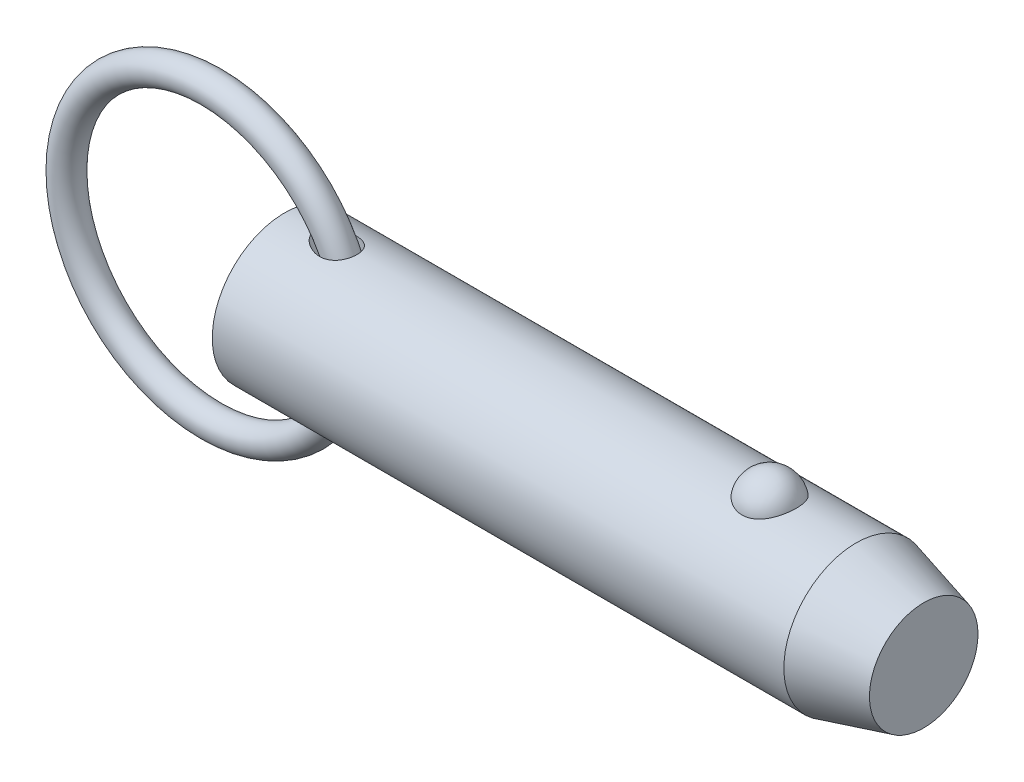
ISO-10303-21;
HEADER;
FILE_DESCRIPTION(('STEP AP214'),'2;1');
FILE_NAME('part.step','',(''),(''),'','','');
FILE_SCHEMA(('AUTOMOTIVE_DESIGN { 1 0 10303 214 1 1 1 1 }'));
ENDSEC;
DATA;
#1=APPLICATION_CONTEXT('core data for automotive mechanical design processes');
#2=APPLICATION_PROTOCOL_DEFINITION('international standard','automotive_design',2000,#1);
#3=PRODUCT_CONTEXT('',#1,'mechanical');
#4=PRODUCT('Part','Part','',(#3));
#5=PRODUCT_RELATED_PRODUCT_CATEGORY('part','',(#4));
#6=PRODUCT_DEFINITION_FORMATION('','',#4);
#7=PRODUCT_DEFINITION_CONTEXT('part definition',#1,'design');
#8=PRODUCT_DEFINITION('design','',#6,#7);
#9=PRODUCT_DEFINITION_SHAPE('','',#8);
#10=(LENGTH_UNIT() NAMED_UNIT(*) SI_UNIT(.MILLI.,.METRE.));
#11=(NAMED_UNIT(*) PLANE_ANGLE_UNIT() SI_UNIT($,.RADIAN.));
#12=(NAMED_UNIT(*) SI_UNIT($,.STERADIAN.) SOLID_ANGLE_UNIT());
#13=UNCERTAINTY_MEASURE_WITH_UNIT(LENGTH_MEASURE(1.E-05),#10,'distance_accuracy_value','');
#14=(GEOMETRIC_REPRESENTATION_CONTEXT(3) GLOBAL_UNCERTAINTY_ASSIGNED_CONTEXT((#13)) GLOBAL_UNIT_ASSIGNED_CONTEXT((#10,
#11,#12)) REPRESENTATION_CONTEXT('',''));
#15=CARTESIAN_POINT('',(0.,0.,0.));
#16=DIRECTION('',(0.,0.,1.));
#17=DIRECTION('',(1.,0.,0.));
#18=AXIS2_PLACEMENT_3D('',#15,#16,#17);
#19=CARTESIAN_POINT('',(-9.66825126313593,0.,0.));
#20=DIRECTION('',(0.,0.,1.));
#21=DIRECTION('',(1.,0.,0.));
#22=AXIS2_PLACEMENT_3D('',#19,#20,#21);
#23=TOROIDAL_SURFACE('',#22,19.05,1.905);
#24=CARTESIAN_POINT('',(11.2867487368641,0.,0.));
#25=VERTEX_POINT('',#24);
#26=VERTEX_LOOP('',#25);
#27=FACE_BOUND('',#26,.T.);
#28=ADVANCED_FACE('P0_F12',(#27),#23,.T.);
#29=CLOSED_SHELL('',(#28));
#30=MANIFOLD_SOLID_BREP('P0_B1',#29);
#31=CARTESIAN_POINT('',(0.,0.,0.));
#32=DIRECTION('',(1.,0.,0.));
#33=DIRECTION('',(0.,0.,-1.));
#34=AXIS2_PLACEMENT_3D('',#31,#32,#33);
#35=CYLINDRICAL_SURFACE('',#34,9.525);
#36=CARTESIAN_POINT('',(4.56693409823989,9.4314194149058,-1.33189820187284));
#37=CARTESIAN_POINT('',(4.70260475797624,9.41020313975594,-1.48215931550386));
#38=CARTESIAN_POINT('',(4.85555680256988,9.38755003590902,-1.61683982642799));
#39=CARTESIAN_POINT('',(5.10171959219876,9.35450554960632,-1.79512943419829));
#40=CARTESIAN_POINT('',(5.18674514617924,9.34362629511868,-1.85068909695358));
#41=CARTESIAN_POINT('',(5.36154389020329,9.32258514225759,-1.95392002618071));
#42=CARTESIAN_POINT('',(5.45131542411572,9.31242299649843,-2.00159402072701));
#43=CARTESIAN_POINT('',(5.70070211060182,9.28632120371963,-2.12033289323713));
#44=CARTESIAN_POINT('',(5.86420408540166,9.27146938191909,-2.18362944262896));
#45=CARTESIAN_POINT('',(6.19893345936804,9.24694163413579,-2.28525783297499));
#46=CARTESIAN_POINT('',(6.3701538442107,9.23726110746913,-2.32361187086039));
#47=CARTESIAN_POINT('',(6.73531776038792,9.22400982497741,-2.37575048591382));
#48=CARTESIAN_POINT('',(6.92975826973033,9.22118808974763,-2.38652934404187));
#49=CARTESIAN_POINT('',(7.21995443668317,9.22416297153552,-2.37494980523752));
#50=CARTESIAN_POINT('',(7.31643847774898,9.22635560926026,-2.366466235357));
#51=CARTESIAN_POINT('',(7.50796421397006,9.2331428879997,-2.33985028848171));
#52=CARTESIAN_POINT('',(7.60300650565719,9.23773650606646,-2.32172202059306));
#53=CARTESIAN_POINT('',(7.83273114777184,9.25183311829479,-2.26504721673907));
#54=CARTESIAN_POINT('',(7.96603028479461,9.26261470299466,-2.2209856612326));
#55=CARTESIAN_POINT('',(8.22310899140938,9.28816519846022,-2.1115730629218));
#56=CARTESIAN_POINT('',(8.34689477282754,9.30293147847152,-2.04623606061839));
#57=CARTESIAN_POINT('',(8.58136049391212,9.3349416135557,-1.89485344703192));
#58=CARTESIAN_POINT('',(8.69199721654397,9.35219324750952,-1.8087422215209));
#59=CARTESIAN_POINT('',(8.89592093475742,9.38707016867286,-1.6179918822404));
#60=CARTESIAN_POINT('',(8.98920771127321,9.40469546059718,-1.51335253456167));
#61=CARTESIAN_POINT('',(9.15057731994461,9.43713590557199,-1.29519427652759));
#62=CARTESIAN_POINT('',(9.21980158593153,9.45205440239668,-1.18253282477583));
#63=CARTESIAN_POINT('',(9.33826736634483,9.47856708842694,-0.946802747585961));
#64=CARTESIAN_POINT('',(9.38751161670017,9.49016173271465,-0.823735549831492));
#65=CARTESIAN_POINT('',(9.46423850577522,9.50859378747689,-0.572614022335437));
#66=CARTESIAN_POINT('',(9.4920239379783,9.5154972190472,-0.444656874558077));
#67=CARTESIAN_POINT('',(9.52636926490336,9.5240690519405,-0.185752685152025));
#68=CARTESIAN_POINT('',(9.5329292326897,9.52573747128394,-0.054805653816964));
#69=CARTESIAN_POINT('',(9.52467276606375,9.52365852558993,0.206503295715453));
#70=CARTESIAN_POINT('',(9.50983454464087,9.51990564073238,0.336864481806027));
#71=CARTESIAN_POINT('',(9.45907362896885,9.50737852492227,0.593166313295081));
#72=CARTESIAN_POINT('',(9.42315106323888,9.49860432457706,0.719106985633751));
#73=CARTESIAN_POINT('',(9.3310664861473,9.4769892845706,0.962959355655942));
#74=CARTESIAN_POINT('',(9.27490839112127,9.46414923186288,1.08087260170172));
#75=CARTESIAN_POINT('',(9.1437580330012,9.43581000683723,1.30534632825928));
#76=CARTESIAN_POINT('',(9.06876720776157,9.42031103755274,1.41190767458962));
#77=CARTESIAN_POINT('',(8.90203187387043,9.38836719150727,1.61069439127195));
#78=CARTESIAN_POINT('',(8.81029913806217,9.371922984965,1.70292975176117));
#79=CARTESIAN_POINT('',(8.6126877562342,9.33985045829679,1.87086859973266));
#80=CARTESIAN_POINT('',(8.50680947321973,9.3242221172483,1.94657251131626));
#81=CARTESIAN_POINT('',(8.28220546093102,9.29513431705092,2.08109032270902));
#82=CARTESIAN_POINT('',(8.16329919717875,9.28171415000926,2.13961034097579));
#83=CARTESIAN_POINT('',(7.91756052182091,9.25859072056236,2.23755716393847));
#84=CARTESIAN_POINT('',(7.79072606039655,9.24888842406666,2.27697900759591));
#85=CARTESIAN_POINT('',(7.52377913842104,9.23338749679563,2.33907806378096));
#86=CARTESIAN_POINT('',(7.3833476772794,9.22789571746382,2.36044900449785));
#87=CARTESIAN_POINT('',(7.1008139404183,9.22210229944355,2.3829751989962));
#88=CARTESIAN_POINT('',(6.95871103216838,9.22180269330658,2.38412253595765));
#89=CARTESIAN_POINT('',(6.65642691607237,9.22632724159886,2.36656230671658));
#90=CARTESIAN_POINT('',(6.49641694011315,9.23185415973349,2.3451317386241));
#91=CARTESIAN_POINT('',(6.18115433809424,9.24811737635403,2.28014143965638));
#92=CARTESIAN_POINT('',(6.02590710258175,9.25885936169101,2.23655754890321));
#93=CARTESIAN_POINT('',(5.69904720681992,9.28624254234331,2.12025087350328));
#94=CARTESIAN_POINT('',(5.52873601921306,9.30354853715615,2.04400672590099));
#95=CARTESIAN_POINT('',(5.20289495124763,9.34106989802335,1.86504730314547));
#96=CARTESIAN_POINT('',(5.0473596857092,9.36128419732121,1.76234172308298));
#97=CARTESIAN_POINT('',(4.79287124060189,9.39697639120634,1.55895334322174));
#98=CARTESIAN_POINT('',(4.6893870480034,9.41240250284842,1.46392900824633));
#99=CARTESIAN_POINT('',(4.4984714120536,9.44202586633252,1.25875918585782));
#100=CARTESIAN_POINT('',(4.41101129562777,9.45622528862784,1.1486413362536));
#101=CARTESIAN_POINT('',(4.27502257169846,9.47888210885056,0.94060098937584));
#102=CARTESIAN_POINT('',(4.22216329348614,9.48791121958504,0.845586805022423));
#103=CARTESIAN_POINT('',(4.13241478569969,9.50344321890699,0.648051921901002));
#104=CARTESIAN_POINT('',(4.09551182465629,9.50994827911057,0.545537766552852));
#105=CARTESIAN_POINT('',(4.04043124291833,9.51971586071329,0.334452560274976));
#106=CARTESIAN_POINT('',(4.0224072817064,9.52295176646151,0.225839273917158));
#107=CARTESIAN_POINT('',(4.00750873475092,9.52562364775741,0.00713006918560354));
#108=CARTESIAN_POINT('',(4.01062334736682,9.52506156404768,-0.102965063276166));
#109=CARTESIAN_POINT('',(4.03592967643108,9.52053221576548,-0.306944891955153));
#110=CARTESIAN_POINT('',(4.05571676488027,9.51699426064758,-0.401151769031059));
#111=CARTESIAN_POINT('',(4.10967975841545,9.5074546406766,-0.585176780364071));
#112=CARTESIAN_POINT('',(4.14385995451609,9.50145224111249,-0.674993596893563));
#113=CARTESIAN_POINT('',(4.23261356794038,9.48611703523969,-0.866116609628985));
#114=CARTESIAN_POINT('',(4.28990016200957,9.47635800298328,-0.966121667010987));
#115=CARTESIAN_POINT('',(4.4185657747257,9.45502867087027,-1.15640011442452));
#116=CARTESIAN_POINT('',(4.48996918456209,9.44345524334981,-1.24665623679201));
#117=CARTESIAN_POINT('',(4.56693409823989,9.4314194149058,-1.33189820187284));
#118=B_SPLINE_CURVE_WITH_KNOTS('',3,(#36,#37,#38,#39,#40,#41,#42,#43,#44,#45,#46,#47,#48,#49,
#50,#51,#52,#53,#54,#55,#56,#57,#58,#59,#60,#61,#62,#63,#64,#65,#66,#67,#68,#69,#70,#71,#72,#73,
#74,#75,#76,#77,#78,#79,#80,#81,#82,#83,#84,#85,#86,#87,#88,#89,#90,#91,#92,#93,#94,#95,#96,#97,
#98,#99,#100,#101,#102,#103,#104,#105,#106,#107,#108,#109,#110,#111,#112,#113,#114,#115,#116,
#117),.UNSPECIFIED.,.T.,.F.,(4,2,2,2,2,2,2,2,2,2,2,2,2,2,2,2,2,2,2,2,2,2,2,2,2,2,2,2,2,2,2,2,2,
2,2,2,2,2,2,2,4),(0.,0.609951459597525,0.916123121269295,1.22218863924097,1.74791337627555,
2.27316961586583,2.85362722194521,3.14383229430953,3.43391382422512,3.85437497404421,
4.27455920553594,4.69608835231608,5.11762282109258,5.51490051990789,5.91212379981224,
6.30363414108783,6.69514313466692,7.0870510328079,7.47895654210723,7.87078624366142,
8.26258603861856,8.65411137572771,9.0456266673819,9.44349251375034,9.84146165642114,
10.2662286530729,10.6911619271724,11.1739180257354,11.6572017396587,12.2170157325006,
12.776624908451,13.1992556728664,13.6211226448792,13.9471990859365,14.2729943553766,
14.6014211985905,14.9296802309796,15.2173810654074,15.505167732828,15.8505863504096,
16.1966070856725),.UNSPECIFIED.);
#119=CARTESIAN_POINT('',(4.56693409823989,9.4314194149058,-1.33189820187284));
#120=VERTEX_POINT('',#119);
#121=EDGE_CURVE('P1_E40',#120,#120,#118,.T.);
#122=ORIENTED_EDGE('',*,*,#121,.T.);
#123=EDGE_LOOP('',(#122));
#124=FACE_BOUND('',#123,.T.);
#125=CARTESIAN_POINT('',(75.2430540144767,0.,0.));
#126=DIRECTION('',(1.,0.,0.));
#127=DIRECTION('',(0.,0.,-1.));
#128=AXIS2_PLACEMENT_3D('',#125,#126,#127);
#129=CIRCLE('',#128,9.525);
#130=CARTESIAN_POINT('',(75.2430540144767,0.,-9.525));
#131=VERTEX_POINT('',#130);
#132=EDGE_CURVE('P1_E25',#131,#131,#129,.T.);
#133=ORIENTED_EDGE('',*,*,#132,.F.);
#134=EDGE_LOOP('',(#133));
#135=FACE_BOUND('',#134,.T.);
#136=CARTESIAN_POINT('',(0.,0.,0.));
#137=DIRECTION('',(1.,0.,0.));
#138=DIRECTION('',(0.,0.,-1.));
#139=AXIS2_PLACEMENT_3D('',#136,#137,#138);
#140=CIRCLE('',#139,9.525);
#141=CARTESIAN_POINT('',(0.,0.,-9.525));
#142=VERTEX_POINT('',#141);
#143=EDGE_CURVE('P1_E9',#142,#142,#140,.T.);
#144=ORIENTED_EDGE('',*,*,#143,.T.);
#145=EDGE_LOOP('',(#144));
#146=FACE_BOUND('',#145,.T.);
#147=CARTESIAN_POINT('',(63.8457573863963,8.80405803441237,3.63513233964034));
#148=CARTESIAN_POINT('',(63.7516766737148,8.80405953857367,3.63513053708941));
#149=CARTESIAN_POINT('',(63.6575618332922,8.80561325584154,3.63137461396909));
#150=CARTESIAN_POINT('',(63.4700126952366,8.81177748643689,3.61638665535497));
#151=CARTESIAN_POINT('',(63.3765788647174,8.81638992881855,3.60514990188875));
#152=CARTESIAN_POINT('',(63.0979452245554,8.8346711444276,3.56024627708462));
#153=CARTESIAN_POINT('',(62.9146916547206,8.85278327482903,3.51538626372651));
#154=CARTESIAN_POINT('',(62.559509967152,8.89871214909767,3.39742145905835));
#155=CARTESIAN_POINT('',(62.3875533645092,8.92650327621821,3.32439116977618));
#156=CARTESIAN_POINT('',(62.0587075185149,8.98874819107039,3.15220244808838));
#157=CARTESIAN_POINT('',(61.9018114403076,9.02319893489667,3.05305594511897));
#158=CARTESIAN_POINT('',(61.6022147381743,9.09629186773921,2.82797815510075));
#159=CARTESIAN_POINT('',(61.4600600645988,9.13502685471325,2.70135138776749));
#160=CARTESIAN_POINT('',(61.1982999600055,9.2118657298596,2.42641932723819));
#161=CARTESIAN_POINT('',(61.0787015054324,9.24996941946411,2.27810735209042));
#162=CARTESIAN_POINT('',(60.859645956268,9.32341082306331,1.95652290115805));
#163=CARTESIAN_POINT('',(60.7613174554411,9.35855090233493,1.78243511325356));
#164=CARTESIAN_POINT('',(60.5938190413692,9.42045142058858,1.41937246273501));
#165=CARTESIAN_POINT('',(60.5246511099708,9.44721128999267,1.23039658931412));
#166=CARTESIAN_POINT('',(60.4161994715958,9.48990641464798,0.84037088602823));
#167=CARTESIAN_POINT('',(60.3772880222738,9.50570658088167,0.639202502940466));
#168=CARTESIAN_POINT('',(60.3315550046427,9.52433146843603,0.232664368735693));
#169=CARTESIAN_POINT('',(60.3247324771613,9.52715657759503,0.0272947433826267));
#170=CARTESIAN_POINT('',(60.343255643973,9.51956918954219,-0.380478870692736));
#171=CARTESIAN_POINT('',(60.3684052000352,9.50923740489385,-0.58289331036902));
#172=CARTESIAN_POINT('',(60.4500253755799,9.47651897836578,-0.980293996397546));
#173=CARTESIAN_POINT('',(60.5064966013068,9.45413210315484,-1.17528009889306));
#174=CARTESIAN_POINT('',(60.6497192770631,9.39954044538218,-1.55263697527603));
#175=CARTESIAN_POINT('',(60.7365124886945,9.36732213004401,-1.73498993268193));
#176=CARTESIAN_POINT('',(60.9386103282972,9.29640700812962,-2.08177763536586));
#177=CARTESIAN_POINT('',(61.0539172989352,9.25770966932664,-2.24621090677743));
#178=CARTESIAN_POINT('',(61.311264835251,9.17775604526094,-2.5533833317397));
#179=CARTESIAN_POINT('',(61.4534344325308,9.136488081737,-2.696011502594));
#180=CARTESIAN_POINT('',(61.76089985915,9.05620497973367,-2.95451229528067));
#181=CARTESIAN_POINT('',(61.926193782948,9.01718965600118,-3.07038711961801));
#182=CARTESIAN_POINT('',(62.272052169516,8.94680019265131,-3.26976836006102));
#183=CARTESIAN_POINT('',(62.4522278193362,8.91528408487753,-3.353897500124));
#184=CARTESIAN_POINT('',(62.8256514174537,8.86272514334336,-3.49043503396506));
#185=CARTESIAN_POINT('',(63.0188944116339,8.84167836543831,-3.54285537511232));
#186=CARTESIAN_POINT('',(63.4025036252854,8.81348056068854,-3.61241306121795));
#187=CARTESIAN_POINT('',(63.5925251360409,8.80568348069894,-3.63119339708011));
#188=CARTESIAN_POINT('',(63.9731906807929,8.80289410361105,-3.63795342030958));
#189=CARTESIAN_POINT('',(64.1638345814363,8.80789922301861,-3.62593932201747));
#190=CARTESIAN_POINT('',(64.534007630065,8.82974915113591,-3.57238430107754));
#191=CARTESIAN_POINT('',(64.7136976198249,8.84621463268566,-3.53178890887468));
#192=CARTESIAN_POINT('',(65.063422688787,8.88875330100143,-3.42331083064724));
#193=CARTESIAN_POINT('',(65.2334569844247,8.91482726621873,-3.35542593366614));
#194=CARTESIAN_POINT('',(65.5632377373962,8.97448239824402,-3.19248225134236));
#195=CARTESIAN_POINT('',(65.7226801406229,9.00821446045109,-3.09686474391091));
#196=CARTESIAN_POINT('',(66.0235136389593,9.07935398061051,-2.88162736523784));
#197=CARTESIAN_POINT('',(66.1649005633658,9.11676228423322,-2.76200196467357));
#198=CARTESIAN_POINT('',(66.4333193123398,9.19347419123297,-2.49516285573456));
#199=CARTESIAN_POINT('',(66.5592750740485,9.23277872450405,-2.34686614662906));
#200=CARTESIAN_POINT('',(66.7855227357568,9.30737610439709,-2.03093683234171));
#201=CARTESIAN_POINT('',(66.8858100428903,9.34266823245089,-1.86330077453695));
#202=CARTESIAN_POINT('',(67.0615149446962,9.40674710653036,-1.50744893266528));
#203=CARTESIAN_POINT('',(67.136041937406,9.43529176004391,-1.31874876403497));
#204=CARTESIAN_POINT('',(67.2541650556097,9.48144132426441,-0.93063102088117));
#205=CARTESIAN_POINT('',(67.2977608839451,9.49904612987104,-0.731213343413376));
#206=CARTESIAN_POINT('',(67.3531580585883,9.5215314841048,-0.327147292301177));
#207=CARTESIAN_POINT('',(67.3649354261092,9.52640243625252,-0.122495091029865));
#208=CARTESIAN_POINT('',(67.3563825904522,9.5228957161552,0.286018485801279));
#209=CARTESIAN_POINT('',(67.3360530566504,9.5145183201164,0.489879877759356));
#210=CARTESIAN_POINT('',(67.2638840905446,9.48544083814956,0.889994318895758));
#211=CARTESIAN_POINT('',(67.2121993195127,9.46480124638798,1.08627971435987));
#212=CARTESIAN_POINT('',(67.0784917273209,9.4133389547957,1.46682086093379));
#213=CARTESIAN_POINT('',(66.9964668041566,9.38251554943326,1.65107577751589));
#214=CARTESIAN_POINT('',(66.8031929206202,9.31365636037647,2.00346348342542));
#215=CARTESIAN_POINT('',(66.6917838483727,9.27558138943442,2.17150083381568));
#216=CARTESIAN_POINT('',(66.4422947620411,9.19638714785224,2.48563115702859));
#217=CARTESIAN_POINT('',(66.3042163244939,9.15526805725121,2.63172542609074));
#218=CARTESIAN_POINT('',(66.0048438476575,9.07465393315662,2.89750997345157));
#219=CARTESIAN_POINT('',(65.8436109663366,9.03515496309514,3.01726776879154));
#220=CARTESIAN_POINT('',(65.5016136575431,8.96227564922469,3.22732920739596));
#221=CARTESIAN_POINT('',(65.320841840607,8.92889763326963,3.31762165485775));
#222=CARTESIAN_POINT('',(64.9514451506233,8.8734538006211,3.46314419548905));
#223=CARTESIAN_POINT('',(64.7633237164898,8.85102983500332,3.51950082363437));
#224=CARTESIAN_POINT('',(64.4757869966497,8.8266696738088,3.57993683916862));
#225=CARTESIAN_POINT('',(64.3791339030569,8.82009725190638,3.5960621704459));
#226=CARTESIAN_POINT('',(64.1846770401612,8.81020897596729,3.62022512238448));
#227=CARTESIAN_POINT('',(64.0868741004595,8.80689090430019,3.62826825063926));
#228=CARTESIAN_POINT('',(63.9412243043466,8.80445615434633,3.63416760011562));
#229=CARTESIAN_POINT('',(63.8934952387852,8.80405727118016,3.63513325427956));
#230=CARTESIAN_POINT('',(63.8457573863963,8.80405803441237,3.63513233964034));
#231=B_SPLINE_CURVE_WITH_KNOTS('',3,(#147,#148,#149,#150,#151,#152,#153,#154,#155,#156,#157,
#158,#159,#160,#161,#162,#163,#164,#165,#166,#167,#168,#169,#170,#171,#172,#173,#174,#175,#176,
#177,#178,#179,#180,#181,#182,#183,#184,#185,#186,#187,#188,#189,#190,#191,#192,#193,#194,#195,
#196,#197,#198,#199,#200,#201,#202,#203,#204,#205,#206,#207,#208,#209,#210,#211,#212,#213,#214,
#215,#216,#217,#218,#219,#220,#221,#222,#223,#224,#225,#226,#227,#228,#229,#230),.UNSPECIFIED.,
.T.,.F.,(4,2,2,2,2,2,2,2,2,2,2,2,2,2,2,2,2,2,2,2,2,2,2,2,2,2,2,2,2,2,2,2,2,2,2,2,2,2,2,2,2,4),
(0.,0.282202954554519,0.564584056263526,1.13017050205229,1.69427128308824,2.25811483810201,
2.83836627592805,3.41879688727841,4.02497117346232,4.63118665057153,5.24474754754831,
5.85829010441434,6.46808687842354,7.07789545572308,7.68854723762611,8.299249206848,
8.91296283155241,9.52662591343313,10.1275338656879,10.7282152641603,11.2986646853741,
11.8689989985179,12.4213015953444,12.973648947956,13.5380053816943,14.1024919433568,
14.695298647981,15.2882113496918,15.8999469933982,16.5116885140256,17.1238909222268,
17.7360805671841,18.3452748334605,18.9545113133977,19.567138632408,20.179729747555,
20.7907316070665,21.4019653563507,21.9915938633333,22.2859053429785,22.5800161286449,
22.7232098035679),.UNSPECIFIED.);
#232=CARTESIAN_POINT('',(63.8457573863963,8.80405803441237,3.63513233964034));
#233=VERTEX_POINT('',#232);
#234=EDGE_CURVE('P1_E34',#233,#233,#231,.T.);
#235=ORIENTED_EDGE('',*,*,#234,.T.);
#236=EDGE_LOOP('',(#235));
#237=FACE_BOUND('',#236,.T.);
#238=CARTESIAN_POINT('',(4.56693409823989,-9.4314194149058,-1.33189820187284));
#239=CARTESIAN_POINT('',(4.48932984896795,-9.4435553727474,-1.24594548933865));
#240=CARTESIAN_POINT('',(4.41737309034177,-9.45522193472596,-1.1548795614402));
#241=CARTESIAN_POINT('',(4.2878104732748,-9.47670896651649,-0.962782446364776));
#242=CARTESIAN_POINT('',(4.23019403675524,-9.48653079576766,-0.861758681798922));
#243=CARTESIAN_POINT('',(4.13254559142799,-9.5034118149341,-0.649723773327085));
#244=CARTESIAN_POINT('',(4.09271158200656,-9.51043980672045,-0.538615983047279));
#245=CARTESIAN_POINT('',(4.04973167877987,-9.51806966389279,-0.367764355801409));
#246=CARTESIAN_POINT('',(4.03820037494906,-9.52012756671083,-0.310118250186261));
#247=CARTESIAN_POINT('',(4.02100287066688,-9.52320274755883,-0.193935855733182));
#248=CARTESIAN_POINT('',(4.01533565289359,-9.52422020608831,-0.135399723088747));
#249=CARTESIAN_POINT('',(4.0081707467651,-9.52550497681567,0.0247266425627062));
#250=CARTESIAN_POINT('',(4.01270492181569,-9.52468821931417,0.126661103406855));
#251=CARTESIAN_POINT('',(4.03954973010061,-9.51988506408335,0.328012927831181));
#252=CARTESIAN_POINT('',(4.06186450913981,-9.51589792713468,0.427429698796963));
#253=CARTESIAN_POINT('',(4.12088980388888,-9.50548528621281,0.616362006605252));
#254=CARTESIAN_POINT('',(4.15684838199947,-9.49918763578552,0.706123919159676));
#255=CARTESIAN_POINT('',(4.24094647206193,-9.48470618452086,0.879522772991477));
#256=CARTESIAN_POINT('',(4.28909090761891,-9.47652162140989,0.963157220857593));
#257=CARTESIAN_POINT('',(4.42295891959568,-9.45426317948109,1.16513741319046));
#258=CARTESIAN_POINT('',(4.51523752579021,-9.43933320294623,1.27905352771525));
#259=CARTESIAN_POINT('',(4.71682295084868,-9.40825940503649,1.49055892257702));
#260=CARTESIAN_POINT('',(4.82617286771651,-9.39211256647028,1.58810554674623));
#261=CARTESIAN_POINT('',(5.09064226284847,-9.35555264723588,1.79246125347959));
#262=CARTESIAN_POINT('',(5.2499041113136,-9.33524115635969,1.89393122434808));
#263=CARTESIAN_POINT('',(5.58309255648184,-9.29785396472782,2.06968659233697));
#264=CARTESIAN_POINT('',(5.7570289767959,-9.28078045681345,2.14395359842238));
#265=CARTESIAN_POINT('',(6.11646882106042,-9.25213303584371,2.26440412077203));
#266=CARTESIAN_POINT('',(6.30205582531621,-9.2406056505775,2.31035092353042));
#267=CARTESIAN_POINT('',(6.67856093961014,-9.22541807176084,2.37029728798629));
#268=CARTESIAN_POINT('',(6.8694704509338,-9.2217458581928,2.3843456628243));
#269=CARTESIAN_POINT('',(7.21217144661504,-9.2234423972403,2.37775005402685));
#270=CARTESIAN_POINT('',(7.36409439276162,-9.22713860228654,2.36352577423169));
#271=CARTESIAN_POINT('',(7.66346227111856,-9.24048072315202,2.31082299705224));
#272=CARTESIAN_POINT('',(7.81090958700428,-9.25012341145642,2.27235765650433));
#273=CARTESIAN_POINT('',(8.09730316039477,-9.2746609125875,2.17003648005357));
#274=CARTESIAN_POINT('',(8.23619652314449,-9.28958517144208,2.10603803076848));
#275=CARTESIAN_POINT('',(8.49918675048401,-9.32290326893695,1.95324442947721));
#276=CARTESIAN_POINT('',(8.62328895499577,-9.34129584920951,1.86445826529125));
#277=CARTESIAN_POINT('',(8.84006515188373,-9.37706953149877,1.67466761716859));
#278=CARTESIAN_POINT('',(8.93465172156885,-9.39436331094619,1.57582357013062));
#279=CARTESIAN_POINT('',(9.1049023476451,-9.42761680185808,1.362809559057));
#280=CARTESIAN_POINT('',(9.18057146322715,-9.44357686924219,1.24864370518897));
#281=CARTESIAN_POINT('',(9.30789178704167,-9.47159985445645,1.01379272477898));
#282=CARTESIAN_POINT('',(9.36045544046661,-9.48380365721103,0.893617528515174));
#283=CARTESIAN_POINT('',(9.44498362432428,-9.50388751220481,0.645890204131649));
#284=CARTESIAN_POINT('',(9.47694947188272,-9.51176784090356,0.518338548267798));
#285=CARTESIAN_POINT('',(9.51944262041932,-9.52232073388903,0.260103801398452));
#286=CARTESIAN_POINT('',(9.53006646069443,-9.52501674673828,0.129437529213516));
#287=CARTESIAN_POINT('',(9.52993291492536,-9.52498309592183,-0.131885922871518));
#288=CARTESIAN_POINT('',(9.5191752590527,-9.52225336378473,-0.262543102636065));
#289=CARTESIAN_POINT('',(9.47648788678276,-9.51165418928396,-0.520312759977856));
#290=CARTESIAN_POINT('',(9.44453086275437,-9.50377811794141,-0.647420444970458));
#291=CARTESIAN_POINT('',(9.36015568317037,-9.48373425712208,-0.894290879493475));
#292=CARTESIAN_POINT('',(9.30773827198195,-9.47156662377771,-1.01405389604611));
#293=CARTESIAN_POINT('',(9.18380895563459,-9.44428888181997,-1.24269386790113));
#294=CARTESIAN_POINT('',(9.11232064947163,-9.42918241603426,-1.35158405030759));
#295=CARTESIAN_POINT('',(8.95212687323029,-9.39767706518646,-1.55562459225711));
#296=CARTESIAN_POINT('',(8.86342281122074,-9.3812782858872,-1.65077607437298));
#297=CARTESIAN_POINT('',(8.6710444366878,-9.34891827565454,-1.8251751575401));
#298=CARTESIAN_POINT('',(8.56732858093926,-9.33295841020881,-1.90437711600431));
#299=CARTESIAN_POINT('',(8.34818438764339,-9.30317889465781,-2.0449122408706));
#300=CARTESIAN_POINT('',(8.23275529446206,-9.28935938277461,-2.10624425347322));
#301=CARTESIAN_POINT('',(7.98961240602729,-9.26475003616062,-2.2120340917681));
#302=CARTESIAN_POINT('',(7.86162088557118,-9.25407358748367,-2.25587700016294));
#303=CARTESIAN_POINT('',(7.60027499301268,-9.23720810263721,-2.32397032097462));
#304=CARTESIAN_POINT('',(7.46691858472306,-9.23102078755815,-2.34821321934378));
#305=CARTESIAN_POINT('',(7.18516230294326,-9.22302718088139,-2.37943079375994));
#306=CARTESIAN_POINT('',(7.03654454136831,-9.22169704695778,-2.38452997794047));
#307=CARTESIAN_POINT('',(6.7401504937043,-9.22442327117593,-2.37395141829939));
#308=CARTESIAN_POINT('',(6.59237455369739,-9.22848170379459,-2.35826567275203));
#309=CARTESIAN_POINT('',(6.27762777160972,-9.2422287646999,-2.30385559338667));
#310=CARTESIAN_POINT('',(6.11124715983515,-9.25269504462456,-2.26192683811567));
#311=CARTESIAN_POINT('',(5.78635920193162,-9.27830776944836,-2.15445569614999));
#312=CARTESIAN_POINT('',(5.62786567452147,-9.29346211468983,-2.08887341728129));
#313=CARTESIAN_POINT('',(5.39013065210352,-9.31931237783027,-1.96924953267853));
#314=CARTESIAN_POINT('',(5.30683088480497,-9.32901725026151,-1.92292485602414));
#315=CARTESIAN_POINT('',(5.1445580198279,-9.34899035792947,-1.82334419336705));
#316=CARTESIAN_POINT('',(5.06558607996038,-9.35925874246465,-1.77008636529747));
#317=CARTESIAN_POINT('',(4.83670950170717,-9.39034445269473,-1.60010986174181));
#318=CARTESIAN_POINT('',(4.69422471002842,-9.41151337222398,-1.47288240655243));
#319=CARTESIAN_POINT('',(4.56693409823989,-9.4314194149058,-1.33189820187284));
#320=B_SPLINE_CURVE_WITH_KNOTS('',3,(#238,#239,#240,#241,#242,#243,#244,#245,#246,#247,#248,
#249,#250,#251,#252,#253,#254,#255,#256,#257,#258,#259,#260,#261,#262,#263,#264,#265,#266,#267,
#268,#269,#270,#271,#272,#273,#274,#275,#276,#277,#278,#279,#280,#281,#282,#283,#284,#285,#286,
#287,#288,#289,#290,#291,#292,#293,#294,#295,#296,#297,#298,#299,#300,#301,#302,#303,#304,#305,
#306,#307,#308,#309,#310,#311,#312,#313,#314,#315,#316,#317,#318,#319),.UNSPECIFIED.,.T.,.F.,(4,
2,2,2,2,2,2,2,2,2,2,2,2,2,2,2,2,2,2,2,2,2,2,2,2,2,2,2,2,2,2,2,2,2,2,2,2,2,2,2,4),(0.,
0.348900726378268,0.697543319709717,1.0499765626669,1.22617690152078,1.40234666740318,
1.70666745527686,2.01105922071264,2.30066493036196,2.59038784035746,3.03001384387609,
3.4707682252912,4.03766594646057,4.60494622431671,5.17690598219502,5.74798989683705,
6.20400848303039,6.65977977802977,7.11813321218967,7.57632066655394,7.98791759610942,
8.39940433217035,8.79273459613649,9.18603970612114,9.57756168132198,9.96908859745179,
10.3611208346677,10.7531388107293,11.1446739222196,11.536177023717,11.9287850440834,
12.3214184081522,12.7268448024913,13.1324265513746,13.5768390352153,14.0214226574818,
14.5351685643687,15.0497849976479,15.3368801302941,15.6240516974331,16.1963372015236),.UNSPECIFIED.);
#321=CARTESIAN_POINT('',(4.56693409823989,-9.4314194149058,-1.33189820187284));
#322=VERTEX_POINT('',#321);
#323=EDGE_CURVE('P1_E17',#322,#322,#320,.T.);
#324=ORIENTED_EDGE('',*,*,#323,.T.);
#325=EDGE_LOOP('',(#324));
#326=FACE_BOUND('',#325,.T.);
#327=ADVANCED_FACE('P1_F13',(#124,#135,#146,#237,#326),#35,.T.);
#328=CARTESIAN_POINT('',(0.,0.,0.));
#329=DIRECTION('',(-1.,0.,0.));
#330=DIRECTION('',(0.,0.,1.));
#331=AXIS2_PLACEMENT_3D('',#328,#329,#330);
#332=PLANE('',#331);
#333=ORIENTED_EDGE('',*,*,#143,.F.);
#334=EDGE_LOOP('',(#333));
#335=FACE_BOUND('',#334,.T.);
#336=ADVANCED_FACE('P1_F15',(#335),#332,.T.);
#337=CARTESIAN_POINT('',(84.13,0.,0.));
#338=DIRECTION('',(-1.,0.,0.));
#339=DIRECTION('',(0.,0.,1.));
#340=AXIS2_PLACEMENT_3D('',#337,#338,#339);
#341=CONICAL_SURFACE('',#340,7.14375000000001,0.26179938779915);
#342=ORIENTED_EDGE('',*,*,#132,.T.);
#343=EDGE_LOOP('',(#342));
#344=FACE_BOUND('',#343,.T.);
#345=CARTESIAN_POINT('',(84.13,0.,0.));
#346=DIRECTION('',(1.,0.,0.));
#347=DIRECTION('',(0.,0.,-1.));
#348=AXIS2_PLACEMENT_3D('',#345,#346,#347);
#349=CIRCLE('',#348,7.14375000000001);
#350=CARTESIAN_POINT('',(84.13,0.,-7.14375000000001));
#351=VERTEX_POINT('',#350);
#352=EDGE_CURVE('P1_E30',#351,#351,#349,.T.);
#353=ORIENTED_EDGE('',*,*,#352,.F.);
#354=EDGE_LOOP('',(#353));
#355=FACE_BOUND('',#354,.T.);
#356=ADVANCED_FACE('P1_F55',(#344,#355),#341,.T.);
#357=CARTESIAN_POINT('',(84.13,7.14375000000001,0.));
#358=DIRECTION('',(1.,0.,0.));
#359=DIRECTION('',(0.,0.,-1.));
#360=AXIS2_PLACEMENT_3D('',#357,#358,#359);
#361=PLANE('',#360);
#362=ORIENTED_EDGE('',*,*,#352,.T.);
#363=EDGE_LOOP('',(#362));
#364=FACE_BOUND('',#363,.T.);
#365=ADVANCED_FACE('P1_F51',(#364),#361,.T.);
#366=CARTESIAN_POINT('',(63.8457573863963,8.5725,0.));
#367=DIRECTION('',(-1.,0.,0.));
#368=DIRECTION('',(0.,1.,0.));
#369=AXIS2_PLACEMENT_3D('',#366,#367,#368);
#370=SPHERICAL_SURFACE('',#369,3.6425);
#371=ORIENTED_EDGE('',*,*,#234,.F.);
#372=EDGE_LOOP('',(#371));
#373=FACE_BOUND('',#372,.T.);
#374=ADVANCED_FACE('P1_F46',(#373),#370,.T.);
#375=CARTESIAN_POINT('',(-9.66825126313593,0.,0.));
#376=DIRECTION('',(0.,0.,1.));
#377=DIRECTION('',(1.,0.,0.));
#378=AXIS2_PLACEMENT_3D('',#375,#376,#377);
#379=TOROIDAL_SURFACE('',#378,19.05,2.38125);
#380=ORIENTED_EDGE('',*,*,#323,.F.);
#381=EDGE_LOOP('',(#380));
#382=FACE_BOUND('',#381,.T.);
#383=ORIENTED_EDGE('',*,*,#121,.F.);
#384=EDGE_LOOP('',(#383));
#385=FACE_BOUND('',#384,.T.);
#386=ADVANCED_FACE('P1_F50',(#382,#385),#379,.F.);
#387=CLOSED_SHELL('',(#327,#336,#356,#365,#374,#386));
#388=MANIFOLD_SOLID_BREP('P1_B1',#387);
#389=ADVANCED_BREP_SHAPE_REPRESENTATION('',(#18,#30,#388),#14);
#390=SHAPE_DEFINITION_REPRESENTATION(#9,#389);
ENDSEC;
END-ISO-10303-21;
